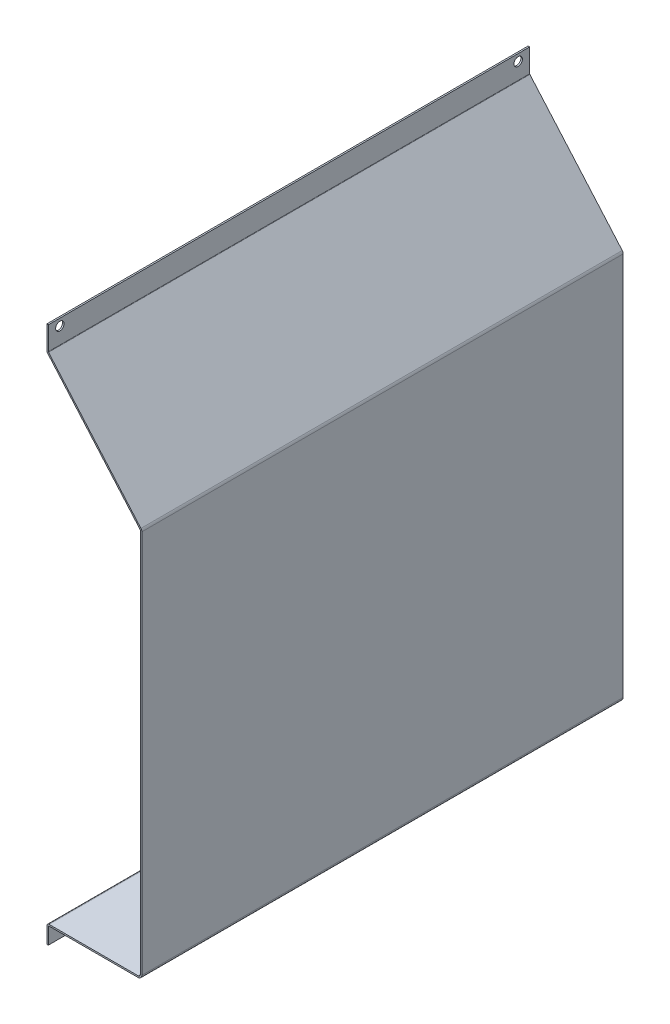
ISO-10303-21;
HEADER;
FILE_DESCRIPTION(('STEP AP214'),'2;1');
FILE_NAME('part.step','',(''),(''),'','','');
FILE_SCHEMA(('AUTOMOTIVE_DESIGN { 1 0 10303 214 1 1 1 1 }'));
ENDSEC;
DATA;
#1=APPLICATION_CONTEXT('core data for automotive mechanical design processes');
#2=APPLICATION_PROTOCOL_DEFINITION('international standard','automotive_design',2000,#1);
#3=PRODUCT_CONTEXT('',#1,'mechanical');
#4=PRODUCT('Part','Part','',(#3));
#5=PRODUCT_RELATED_PRODUCT_CATEGORY('part','',(#4));
#6=PRODUCT_DEFINITION_FORMATION('','',#4);
#7=PRODUCT_DEFINITION_CONTEXT('part definition',#1,'design');
#8=PRODUCT_DEFINITION('design','',#6,#7);
#9=PRODUCT_DEFINITION_SHAPE('','',#8);
#10=(LENGTH_UNIT() NAMED_UNIT(*) SI_UNIT(.MILLI.,.METRE.));
#11=(NAMED_UNIT(*) PLANE_ANGLE_UNIT() SI_UNIT($,.RADIAN.));
#12=(NAMED_UNIT(*) SI_UNIT($,.STERADIAN.) SOLID_ANGLE_UNIT());
#13=UNCERTAINTY_MEASURE_WITH_UNIT(LENGTH_MEASURE(1.E-05),#10,'distance_accuracy_value','');
#14=(GEOMETRIC_REPRESENTATION_CONTEXT(3) GLOBAL_UNCERTAINTY_ASSIGNED_CONTEXT((#13)) GLOBAL_UNIT_ASSIGNED_CONTEXT((#10,
#11,#12)) REPRESENTATION_CONTEXT('',''));
#15=CARTESIAN_POINT('',(0.,0.,0.));
#16=DIRECTION('',(0.,0.,1.));
#17=DIRECTION('',(1.,0.,0.));
#18=AXIS2_PLACEMENT_3D('',#15,#16,#17);
#19=CARTESIAN_POINT('',(1.,0.,157.));
#20=DIRECTION('',(0.,1.,0.));
#21=DIRECTION('',(0.,0.,1.));
#22=AXIS2_PLACEMENT_3D('',#19,#20,#21);
#23=PLANE('',#22);
#24=DIRECTION('',(1.,0.,0.));
#25=VECTOR('',#24,1.);
#26=CARTESIAN_POINT('',(1.,0.,-157.));
#27=LINE('',#26,#25);
#28=CARTESIAN_POINT('',(0.,0.,-157.));
#29=VERTEX_POINT('',#28);
#30=CARTESIAN_POINT('',(1.,0.,-157.));
#31=VERTEX_POINT('',#30);
#32=EDGE_CURVE('E170',#29,#31,#27,.T.);
#33=ORIENTED_EDGE('',*,*,#32,.T.);
#34=DIRECTION('',(0.,0.,-1.));
#35=VECTOR('',#34,1.);
#36=CARTESIAN_POINT('',(1.,0.,157.));
#37=LINE('',#36,#35);
#38=CARTESIAN_POINT('',(1.,0.,157.));
#39=VERTEX_POINT('',#38);
#40=EDGE_CURVE('E11',#39,#31,#37,.T.);
#41=ORIENTED_EDGE('',*,*,#40,.F.);
#42=DIRECTION('',(1.,0.,0.));
#43=VECTOR('',#42,1.);
#44=CARTESIAN_POINT('',(1.,0.,157.));
#45=LINE('',#44,#43);
#46=CARTESIAN_POINT('',(0.,0.,157.));
#47=VERTEX_POINT('',#46);
#48=EDGE_CURVE('E226',#47,#39,#45,.T.);
#49=ORIENTED_EDGE('',*,*,#48,.F.);
#50=DIRECTION('',(0.,0.,-1.));
#51=VECTOR('',#50,1.);
#52=CARTESIAN_POINT('',(0.,0.,157.));
#53=LINE('',#52,#51);
#54=EDGE_CURVE('E183',#47,#29,#53,.T.);
#55=ORIENTED_EDGE('',*,*,#54,.T.);
#56=EDGE_LOOP('',(#33,#41,#49,#55));
#57=FACE_BOUND('',#56,.T.);
#58=ADVANCED_FACE('F30',(#57),#23,.F.);
#59=CARTESIAN_POINT('',(1.,0.,157.));
#60=DIRECTION('',(-1.,0.,0.));
#61=DIRECTION('',(0.,0.,1.));
#62=AXIS2_PLACEMENT_3D('',#59,#60,#61);
#63=PLANE('',#62);
#64=CARTESIAN_POINT('',(1.,4.5,0.));
#65=DIRECTION('',(-1.,0.,0.));
#66=DIRECTION('',(0.,0.,1.));
#67=AXIS2_PLACEMENT_3D('',#64,#65,#66);
#68=CIRCLE('',#67,2.75);
#69=CARTESIAN_POINT('',(1.,4.5,2.75));
#70=VERTEX_POINT('',#69);
#71=EDGE_CURVE('E535',#70,#70,#68,.T.);
#72=ORIENTED_EDGE('',*,*,#71,.T.);
#73=EDGE_LOOP('',(#72));
#74=FACE_BOUND('',#73,.T.);
#75=DIRECTION('',(0.,1.,0.));
#76=VECTOR('',#75,1.);
#77=CARTESIAN_POINT('',(1.,0.,-157.));
#78=LINE('',#77,#76);
#79=CARTESIAN_POINT('',(1.,10.5,-157.));
#80=VERTEX_POINT('',#79);
#81=EDGE_CURVE('E166',#31,#80,#78,.T.);
#82=ORIENTED_EDGE('',*,*,#81,.T.);
#83=DIRECTION('',(0.,0.,-1.));
#84=VECTOR('',#83,1.);
#85=CARTESIAN_POINT('',(1.,10.5,157.));
#86=LINE('',#85,#84);
#87=CARTESIAN_POINT('',(1.,10.5,157.));
#88=VERTEX_POINT('',#87);
#89=EDGE_CURVE('E37',#88,#80,#86,.T.);
#90=ORIENTED_EDGE('',*,*,#89,.F.);
#91=DIRECTION('',(0.,1.,0.));
#92=VECTOR('',#91,1.);
#93=CARTESIAN_POINT('',(1.,0.,157.));
#94=LINE('',#93,#92);
#95=EDGE_CURVE('E179',#39,#88,#94,.T.);
#96=ORIENTED_EDGE('',*,*,#95,.F.);
#97=ORIENTED_EDGE('',*,*,#40,.T.);
#98=EDGE_LOOP('',(#82,#90,#96,#97));
#99=FACE_BOUND('',#98,.T.);
#100=ADVANCED_FACE('F178',(#74,#99),#63,.F.);
#101=CARTESIAN_POINT('',(1.5,10.5,157.));
#102=DIRECTION('',(0.,0.,-1.));
#103=DIRECTION('',(-1.,0.,0.));
#104=AXIS2_PLACEMENT_3D('',#101,#102,#103);
#105=CYLINDRICAL_SURFACE('',#104,0.499999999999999);
#106=CARTESIAN_POINT('',(1.5,10.5,-157.));
#107=DIRECTION('',(0.,0.,-1.));
#108=DIRECTION('',(-1.,0.,0.));
#109=AXIS2_PLACEMENT_3D('',#106,#107,#108);
#110=CIRCLE('',#109,0.499999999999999);
#111=CARTESIAN_POINT('',(1.5,11.,-157.));
#112=VERTEX_POINT('',#111);
#113=EDGE_CURVE('E172',#80,#112,#110,.T.);
#114=ORIENTED_EDGE('',*,*,#113,.T.);
#115=DIRECTION('',(0.,0.,-1.));
#116=VECTOR('',#115,1.);
#117=CARTESIAN_POINT('',(1.5,11.,157.));
#118=LINE('',#117,#116);
#119=CARTESIAN_POINT('',(1.5,11.,157.));
#120=VERTEX_POINT('',#119);
#121=EDGE_CURVE('E312',#120,#112,#118,.T.);
#122=ORIENTED_EDGE('',*,*,#121,.F.);
#123=CARTESIAN_POINT('',(1.5,10.5,157.));
#124=DIRECTION('',(0.,0.,-1.));
#125=DIRECTION('',(-1.,0.,0.));
#126=AXIS2_PLACEMENT_3D('',#123,#124,#125);
#127=CIRCLE('',#126,0.499999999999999);
#128=EDGE_CURVE('E229',#88,#120,#127,.T.);
#129=ORIENTED_EDGE('',*,*,#128,.F.);
#130=ORIENTED_EDGE('',*,*,#89,.T.);
#131=EDGE_LOOP('',(#114,#122,#129,#130));
#132=FACE_BOUND('',#131,.T.);
#133=ADVANCED_FACE('F316',(#132),#105,.F.);
#134=CARTESIAN_POINT('',(1.5,11.,157.));
#135=DIRECTION('',(0.,1.,0.));
#136=DIRECTION('',(0.,0.,1.));
#137=AXIS2_PLACEMENT_3D('',#134,#135,#136);
#138=PLANE('',#137);
#139=DIRECTION('',(1.,0.,0.));
#140=VECTOR('',#139,1.);
#141=CARTESIAN_POINT('',(1.5,11.,-157.));
#142=LINE('',#141,#140);
#143=CARTESIAN_POINT('',(59.5,11.,-157.));
#144=VERTEX_POINT('',#143);
#145=EDGE_CURVE('E192',#112,#144,#142,.T.);
#146=ORIENTED_EDGE('',*,*,#145,.T.);
#147=DIRECTION('',(0.,0.,-1.));
#148=VECTOR('',#147,1.);
#149=CARTESIAN_POINT('',(59.5,11.,157.));
#150=LINE('',#149,#148);
#151=CARTESIAN_POINT('',(59.5,11.,157.));
#152=VERTEX_POINT('',#151);
#153=EDGE_CURVE('E309',#152,#144,#150,.T.);
#154=ORIENTED_EDGE('',*,*,#153,.F.);
#155=DIRECTION('',(1.,0.,0.));
#156=VECTOR('',#155,1.);
#157=CARTESIAN_POINT('',(1.5,11.,157.));
#158=LINE('',#157,#156);
#159=EDGE_CURVE('E231',#120,#152,#158,.T.);
#160=ORIENTED_EDGE('',*,*,#159,.F.);
#161=ORIENTED_EDGE('',*,*,#121,.T.);
#162=EDGE_LOOP('',(#146,#154,#160,#161));
#163=FACE_BOUND('',#162,.T.);
#164=ADVANCED_FACE('F324',(#163),#138,.F.);
#165=CARTESIAN_POINT('',(59.5,13.5,157.));
#166=DIRECTION('',(0.,0.,-1.));
#167=DIRECTION('',(-1.,0.,0.));
#168=AXIS2_PLACEMENT_3D('',#165,#166,#167);
#169=CYLINDRICAL_SURFACE('',#168,2.5);
#170=CARTESIAN_POINT('',(59.5,13.5,-157.));
#171=DIRECTION('',(0.,0.,1.));
#172=DIRECTION('',(1.,0.,0.));
#173=AXIS2_PLACEMENT_3D('',#170,#171,#172);
#174=CIRCLE('',#173,2.5);
#175=CARTESIAN_POINT('',(62.,13.5,-157.));
#176=VERTEX_POINT('',#175);
#177=EDGE_CURVE('E194',#144,#176,#174,.T.);
#178=ORIENTED_EDGE('',*,*,#177,.T.);
#179=DIRECTION('',(0.,0.,-1.));
#180=VECTOR('',#179,1.);
#181=CARTESIAN_POINT('',(62.,13.5,157.));
#182=LINE('',#181,#180);
#183=CARTESIAN_POINT('',(62.,13.5,157.));
#184=VERTEX_POINT('',#183);
#185=EDGE_CURVE('E306',#184,#176,#182,.T.);
#186=ORIENTED_EDGE('',*,*,#185,.F.);
#187=CARTESIAN_POINT('',(59.5,13.5,157.));
#188=DIRECTION('',(0.,0.,1.));
#189=DIRECTION('',(1.,0.,0.));
#190=AXIS2_PLACEMENT_3D('',#187,#188,#189);
#191=CIRCLE('',#190,2.5);
#192=EDGE_CURVE('E233',#152,#184,#191,.T.);
#193=ORIENTED_EDGE('',*,*,#192,.F.);
#194=ORIENTED_EDGE('',*,*,#153,.T.);
#195=EDGE_LOOP('',(#178,#186,#193,#194));
#196=FACE_BOUND('',#195,.T.);
#197=ADVANCED_FACE('F327',(#196),#169,.T.);
#198=CARTESIAN_POINT('',(62.,13.5,157.));
#199=DIRECTION('',(-1.,0.,0.));
#200=DIRECTION('',(0.,0.,1.));
#201=AXIS2_PLACEMENT_3D('',#198,#199,#200);
#202=PLANE('',#201);
#203=DIRECTION('',(0.,1.,0.));
#204=VECTOR('',#203,1.);
#205=CARTESIAN_POINT('',(62.,13.5,-157.));
#206=LINE('',#205,#204);
#207=CARTESIAN_POINT('',(62.,264.039172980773,-157.));
#208=VERTEX_POINT('',#207);
#209=EDGE_CURVE('E196',#176,#208,#206,.T.);
#210=ORIENTED_EDGE('',*,*,#209,.T.);
#211=DIRECTION('',(0.,0.,-1.));
#212=VECTOR('',#211,1.);
#213=CARTESIAN_POINT('',(62.,264.039172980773,157.));
#214=LINE('',#213,#212);
#215=CARTESIAN_POINT('',(62.,264.039172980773,157.));
#216=VERTEX_POINT('',#215);
#217=EDGE_CURVE('E303',#216,#208,#214,.T.);
#218=ORIENTED_EDGE('',*,*,#217,.F.);
#219=DIRECTION('',(0.,1.,0.));
#220=VECTOR('',#219,1.);
#221=CARTESIAN_POINT('',(62.,13.5,157.));
#222=LINE('',#221,#220);
#223=EDGE_CURVE('E235',#184,#216,#222,.T.);
#224=ORIENTED_EDGE('',*,*,#223,.F.);
#225=ORIENTED_EDGE('',*,*,#185,.T.);
#226=EDGE_LOOP('',(#210,#218,#224,#225));
#227=FACE_BOUND('',#226,.T.);
#228=ADVANCED_FACE('F332',(#227),#202,.F.);
#229=CARTESIAN_POINT('',(59.5,264.039172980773,157.));
#230=DIRECTION('',(0.,0.,-1.));
#231=DIRECTION('',(-1.,0.,0.));
#232=AXIS2_PLACEMENT_3D('',#229,#230,#231);
#233=CYLINDRICAL_SURFACE('',#232,2.5);
#234=CARTESIAN_POINT('',(59.5,264.039172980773,-157.));
#235=DIRECTION('',(0.,0.,1.));
#236=DIRECTION('',(1.,0.,0.));
#237=AXIS2_PLACEMENT_3D('',#234,#235,#236);
#238=CIRCLE('',#237,2.5);
#239=CARTESIAN_POINT('',(61.3867739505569,265.679320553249,-157.));
#240=VERTEX_POINT('',#239);
#241=EDGE_CURVE('E198',#208,#240,#238,.T.);
#242=ORIENTED_EDGE('',*,*,#241,.T.);
#243=DIRECTION('',(0.,0.,-1.));
#244=VECTOR('',#243,1.);
#245=CARTESIAN_POINT('',(61.3867739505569,265.679320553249,157.));
#246=LINE('',#245,#244);
#247=CARTESIAN_POINT('',(61.3867739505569,265.679320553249,157.));
#248=VERTEX_POINT('',#247);
#249=EDGE_CURVE('E300',#248,#240,#246,.T.);
#250=ORIENTED_EDGE('',*,*,#249,.F.);
#251=CARTESIAN_POINT('',(59.5,264.039172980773,157.));
#252=DIRECTION('',(0.,0.,1.));
#253=DIRECTION('',(1.,0.,0.));
#254=AXIS2_PLACEMENT_3D('',#251,#252,#253);
#255=CIRCLE('',#254,2.5);
#256=EDGE_CURVE('E237',#216,#248,#255,.T.);
#257=ORIENTED_EDGE('',*,*,#256,.F.);
#258=ORIENTED_EDGE('',*,*,#217,.T.);
#259=EDGE_LOOP('',(#242,#250,#257,#258));
#260=FACE_BOUND('',#259,.T.);
#261=ADVANCED_FACE('F338',(#260),#233,.T.);
#262=CARTESIAN_POINT('',(61.3867739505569,265.679320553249,157.));
#263=DIRECTION('',(-0.754709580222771,-0.656059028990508,0.));
#264=DIRECTION('',(0.656059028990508,-0.754709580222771,0.));
#265=AXIS2_PLACEMENT_3D('',#262,#263,#264);
#266=PLANE('',#265);
#267=DIRECTION('',(-0.656059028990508,0.754709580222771,0.));
#268=VECTOR('',#267,1.);
#269=CARTESIAN_POINT('',(61.3867739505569,265.679320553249,-157.));
#270=LINE('',#269,#268);
#271=CARTESIAN_POINT('',(1.12264520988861,335.005270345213,-157.));
#272=VERTEX_POINT('',#271);
#273=EDGE_CURVE('E200',#240,#272,#270,.T.);
#274=ORIENTED_EDGE('',*,*,#273,.T.);
#275=DIRECTION('',(0.,0.,-1.));
#276=VECTOR('',#275,1.);
#277=CARTESIAN_POINT('',(1.12264520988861,335.005270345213,157.));
#278=LINE('',#277,#276);
#279=CARTESIAN_POINT('',(1.12264520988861,335.005270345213,157.));
#280=VERTEX_POINT('',#279);
#281=EDGE_CURVE('E297',#280,#272,#278,.T.);
#282=ORIENTED_EDGE('',*,*,#281,.F.);
#283=DIRECTION('',(-0.656059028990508,0.754709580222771,0.));
#284=VECTOR('',#283,1.);
#285=CARTESIAN_POINT('',(61.3867739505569,265.679320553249,157.));
#286=LINE('',#285,#284);
#287=EDGE_CURVE('E239',#248,#280,#286,.T.);
#288=ORIENTED_EDGE('',*,*,#287,.F.);
#289=ORIENTED_EDGE('',*,*,#249,.T.);
#290=EDGE_LOOP('',(#274,#282,#288,#289));
#291=FACE_BOUND('',#290,.T.);
#292=ADVANCED_FACE('F342',(#291),#266,.F.);
#293=CARTESIAN_POINT('',(1.5,335.333299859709,157.));
#294=DIRECTION('',(0.,0.,-1.));
#295=DIRECTION('',(-1.,0.,0.));
#296=AXIS2_PLACEMENT_3D('',#293,#294,#295);
#297=CYLINDRICAL_SURFACE('',#296,0.499999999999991);
#298=CARTESIAN_POINT('',(1.5,335.333299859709,-157.));
#299=DIRECTION('',(0.,0.,-1.));
#300=DIRECTION('',(-1.,0.,0.));
#301=AXIS2_PLACEMENT_3D('',#298,#299,#300);
#302=CIRCLE('',#301,0.499999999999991);
#303=CARTESIAN_POINT('',(1.00000000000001,335.333299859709,-157.));
#304=VERTEX_POINT('',#303);
#305=EDGE_CURVE('E202',#272,#304,#302,.T.);
#306=ORIENTED_EDGE('',*,*,#305,.T.);
#307=DIRECTION('',(0.,0.,-1.));
#308=VECTOR('',#307,1.);
#309=CARTESIAN_POINT('',(1.00000000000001,335.333299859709,157.));
#310=LINE('',#309,#308);
#311=CARTESIAN_POINT('',(1.00000000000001,335.333299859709,157.));
#312=VERTEX_POINT('',#311);
#313=EDGE_CURVE('E294',#312,#304,#310,.T.);
#314=ORIENTED_EDGE('',*,*,#313,.F.);
#315=CARTESIAN_POINT('',(1.5,335.333299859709,157.));
#316=DIRECTION('',(0.,0.,-1.));
#317=DIRECTION('',(-1.,0.,0.));
#318=AXIS2_PLACEMENT_3D('',#315,#316,#317);
#319=CIRCLE('',#318,0.499999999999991);
#320=EDGE_CURVE('E241',#280,#312,#319,.T.);
#321=ORIENTED_EDGE('',*,*,#320,.F.);
#322=ORIENTED_EDGE('',*,*,#281,.T.);
#323=EDGE_LOOP('',(#306,#314,#321,#322));
#324=FACE_BOUND('',#323,.T.);
#325=ADVANCED_FACE('F347',(#324),#297,.F.);
#326=CARTESIAN_POINT('',(1.00000000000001,335.333299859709,157.));
#327=DIRECTION('',(-1.,0.,0.));
#328=DIRECTION('',(0.,-1.,0.));
#329=AXIS2_PLACEMENT_3D('',#326,#327,#328);
#330=PLANE('',#329);
#331=CARTESIAN_POINT('',(1.,346.,149.5));
#332=DIRECTION('',(-1.,0.,0.));
#333=DIRECTION('',(0.,-1.,0.));
#334=AXIS2_PLACEMENT_3D('',#331,#332,#333);
#335=CIRCLE('',#334,2.75000000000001);
#336=CARTESIAN_POINT('',(1.,343.25,149.5));
#337=VERTEX_POINT('',#336);
#338=EDGE_CURVE('E539',#337,#337,#335,.T.);
#339=ORIENTED_EDGE('',*,*,#338,.T.);
#340=EDGE_LOOP('',(#339));
#341=FACE_BOUND('',#340,.T.);
#342=CARTESIAN_POINT('',(1.,346.,-149.5));
#343=DIRECTION('',(-1.,0.,0.));
#344=DIRECTION('',(0.,-1.,0.));
#345=AXIS2_PLACEMENT_3D('',#342,#343,#344);
#346=CIRCLE('',#345,2.75000000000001);
#347=CARTESIAN_POINT('',(1.,343.25,-149.5));
#348=VERTEX_POINT('',#347);
#349=EDGE_CURVE('E184',#348,#348,#346,.T.);
#350=ORIENTED_EDGE('',*,*,#349,.T.);
#351=EDGE_LOOP('',(#350));
#352=FACE_BOUND('',#351,.T.);
#353=DIRECTION('',(0.,1.,0.));
#354=VECTOR('',#353,1.);
#355=CARTESIAN_POINT('',(1.00000000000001,335.333299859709,-157.));
#356=LINE('',#355,#354);
#357=CARTESIAN_POINT('',(1.,350.5,-157.));
#358=VERTEX_POINT('',#357);
#359=EDGE_CURVE('E204',#304,#358,#356,.T.);
#360=ORIENTED_EDGE('',*,*,#359,.T.);
#361=DIRECTION('',(0.,0.,-1.));
#362=VECTOR('',#361,1.);
#363=CARTESIAN_POINT('',(1.,350.5,157.));
#364=LINE('',#363,#362);
#365=CARTESIAN_POINT('',(1.,350.5,157.));
#366=VERTEX_POINT('',#365);
#367=EDGE_CURVE('E291',#366,#358,#364,.T.);
#368=ORIENTED_EDGE('',*,*,#367,.F.);
#369=DIRECTION('',(0.,1.,0.));
#370=VECTOR('',#369,1.);
#371=CARTESIAN_POINT('',(1.00000000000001,335.333299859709,157.));
#372=LINE('',#371,#370);
#373=EDGE_CURVE('E243',#312,#366,#372,.T.);
#374=ORIENTED_EDGE('',*,*,#373,.F.);
#375=ORIENTED_EDGE('',*,*,#313,.T.);
#376=EDGE_LOOP('',(#360,#368,#374,#375));
#377=FACE_BOUND('',#376,.T.);
#378=ADVANCED_FACE('F353',(#341,#352,#377),#330,.F.);
#379=CARTESIAN_POINT('',(0.,350.5,157.));
#380=DIRECTION('',(0.,-1.,0.));
#381=DIRECTION('',(0.,0.,-1.));
#382=AXIS2_PLACEMENT_3D('',#379,#380,#381);
#383=PLANE('',#382);
#384=DIRECTION('',(-1.,0.,0.));
#385=VECTOR('',#384,1.);
#386=CARTESIAN_POINT('',(0.,350.5,-157.));
#387=LINE('',#386,#385);
#388=CARTESIAN_POINT('',(0.,350.5,-157.));
#389=VERTEX_POINT('',#388);
#390=EDGE_CURVE('E206',#358,#389,#387,.T.);
#391=ORIENTED_EDGE('',*,*,#390,.T.);
#392=DIRECTION('',(0.,0.,-1.));
#393=VECTOR('',#392,1.);
#394=CARTESIAN_POINT('',(0.,350.5,157.));
#395=LINE('',#394,#393);
#396=CARTESIAN_POINT('',(0.,350.5,157.));
#397=VERTEX_POINT('',#396);
#398=EDGE_CURVE('E288',#397,#389,#395,.T.);
#399=ORIENTED_EDGE('',*,*,#398,.F.);
#400=DIRECTION('',(-1.,0.,0.));
#401=VECTOR('',#400,1.);
#402=CARTESIAN_POINT('',(0.,350.5,157.));
#403=LINE('',#402,#401);
#404=EDGE_CURVE('E245',#366,#397,#403,.T.);
#405=ORIENTED_EDGE('',*,*,#404,.F.);
#406=ORIENTED_EDGE('',*,*,#367,.T.);
#407=EDGE_LOOP('',(#391,#399,#405,#406));
#408=FACE_BOUND('',#407,.T.);
#409=ADVANCED_FACE('F357',(#408),#383,.F.);
#410=CARTESIAN_POINT('',(0.,335.333299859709,157.));
#411=DIRECTION('',(1.,0.,0.));
#412=DIRECTION('',(0.,0.,-1.));
#413=AXIS2_PLACEMENT_3D('',#410,#411,#412);
#414=PLANE('',#413);
#415=CARTESIAN_POINT('',(0.,346.,149.5));
#416=DIRECTION('',(-1.,0.,0.));
#417=DIRECTION('',(0.,0.,-1.));
#418=AXIS2_PLACEMENT_3D('',#415,#416,#417);
#419=CIRCLE('',#418,2.75000000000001);
#420=CARTESIAN_POINT('',(0.,346.,146.75));
#421=VERTEX_POINT('',#420);
#422=EDGE_CURVE('E536',#421,#421,#419,.T.);
#423=ORIENTED_EDGE('',*,*,#422,.F.);
#424=EDGE_LOOP('',(#423));
#425=FACE_BOUND('',#424,.T.);
#426=CARTESIAN_POINT('',(0.,346.,-149.5));
#427=DIRECTION('',(-1.,0.,0.));
#428=DIRECTION('',(0.,0.,1.));
#429=AXIS2_PLACEMENT_3D('',#426,#427,#428);
#430=CIRCLE('',#429,2.75000000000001);
#431=CARTESIAN_POINT('',(0.,346.,-146.75));
#432=VERTEX_POINT('',#431);
#433=EDGE_CURVE('E187',#432,#432,#430,.T.);
#434=ORIENTED_EDGE('',*,*,#433,.F.);
#435=EDGE_LOOP('',(#434));
#436=FACE_BOUND('',#435,.T.);
#437=DIRECTION('',(0.,-1.,0.));
#438=VECTOR('',#437,1.);
#439=CARTESIAN_POINT('',(0.,335.333299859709,-157.));
#440=LINE('',#439,#438);
#441=CARTESIAN_POINT('',(0.,335.333299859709,-157.));
#442=VERTEX_POINT('',#441);
#443=EDGE_CURVE('E208',#389,#442,#440,.T.);
#444=ORIENTED_EDGE('',*,*,#443,.T.);
#445=DIRECTION('',(0.,0.,-1.));
#446=VECTOR('',#445,1.);
#447=CARTESIAN_POINT('',(0.,335.333299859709,157.));
#448=LINE('',#447,#446);
#449=CARTESIAN_POINT('',(0.,335.333299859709,157.));
#450=VERTEX_POINT('',#449);
#451=EDGE_CURVE('E285',#450,#442,#448,.T.);
#452=ORIENTED_EDGE('',*,*,#451,.F.);
#453=DIRECTION('',(0.,-1.,0.));
#454=VECTOR('',#453,1.);
#455=CARTESIAN_POINT('',(0.,335.333299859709,157.));
#456=LINE('',#455,#454);
#457=EDGE_CURVE('E247',#397,#450,#456,.T.);
#458=ORIENTED_EDGE('',*,*,#457,.F.);
#459=ORIENTED_EDGE('',*,*,#398,.T.);
#460=EDGE_LOOP('',(#444,#452,#458,#459));
#461=FACE_BOUND('',#460,.T.);
#462=ADVANCED_FACE('F362',(#425,#436,#461),#414,.F.);
#463=CARTESIAN_POINT('',(1.5,335.333299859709,157.));
#464=DIRECTION('',(0.,0.,-1.));
#465=DIRECTION('',(-1.,0.,0.));
#466=AXIS2_PLACEMENT_3D('',#463,#464,#465);
#467=CYLINDRICAL_SURFACE('',#466,1.49999999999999);
#468=CARTESIAN_POINT('',(1.5,335.333299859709,-157.));
#469=DIRECTION('',(0.,0.,1.));
#470=DIRECTION('',(-1.,0.,0.));
#471=AXIS2_PLACEMENT_3D('',#468,#469,#470);
#472=CIRCLE('',#471,1.49999999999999);
#473=CARTESIAN_POINT('',(0.367935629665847,334.349211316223,-157.));
#474=VERTEX_POINT('',#473);
#475=EDGE_CURVE('E210',#442,#474,#472,.T.);
#476=ORIENTED_EDGE('',*,*,#475,.T.);
#477=DIRECTION('',(0.,0.,-1.));
#478=VECTOR('',#477,1.);
#479=CARTESIAN_POINT('',(0.367935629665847,334.349211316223,157.));
#480=LINE('',#479,#478);
#481=CARTESIAN_POINT('',(0.367935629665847,334.349211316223,157.));
#482=VERTEX_POINT('',#481);
#483=EDGE_CURVE('E282',#482,#474,#480,.T.);
#484=ORIENTED_EDGE('',*,*,#483,.F.);
#485=CARTESIAN_POINT('',(1.5,335.333299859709,157.));
#486=DIRECTION('',(0.,0.,1.));
#487=DIRECTION('',(-1.,0.,0.));
#488=AXIS2_PLACEMENT_3D('',#485,#486,#487);
#489=CIRCLE('',#488,1.49999999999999);
#490=EDGE_CURVE('E249',#450,#482,#489,.T.);
#491=ORIENTED_EDGE('',*,*,#490,.F.);
#492=ORIENTED_EDGE('',*,*,#451,.T.);
#493=EDGE_LOOP('',(#476,#484,#491,#492));
#494=FACE_BOUND('',#493,.T.);
#495=ADVANCED_FACE('F368',(#494),#467,.T.);
#496=CARTESIAN_POINT('',(60.6320643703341,265.023261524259,157.));
#497=DIRECTION('',(0.754709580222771,0.656059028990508,0.));
#498=DIRECTION('',(-0.656059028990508,0.754709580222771,0.));
#499=AXIS2_PLACEMENT_3D('',#496,#497,#498);
#500=PLANE('',#499);
#501=DIRECTION('',(0.656059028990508,-0.754709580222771,0.));
#502=VECTOR('',#501,1.);
#503=CARTESIAN_POINT('',(60.6320643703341,265.023261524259,-157.));
#504=LINE('',#503,#502);
#505=CARTESIAN_POINT('',(60.6320643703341,265.023261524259,-157.));
#506=VERTEX_POINT('',#505);
#507=EDGE_CURVE('E212',#474,#506,#504,.T.);
#508=ORIENTED_EDGE('',*,*,#507,.T.);
#509=DIRECTION('',(0.,0.,-1.));
#510=VECTOR('',#509,1.);
#511=CARTESIAN_POINT('',(60.6320643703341,265.023261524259,157.));
#512=LINE('',#511,#510);
#513=CARTESIAN_POINT('',(60.6320643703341,265.023261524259,157.));
#514=VERTEX_POINT('',#513);
#515=EDGE_CURVE('E279',#514,#506,#512,.T.);
#516=ORIENTED_EDGE('',*,*,#515,.F.);
#517=DIRECTION('',(0.656059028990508,-0.754709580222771,0.));
#518=VECTOR('',#517,1.);
#519=CARTESIAN_POINT('',(60.6320643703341,265.023261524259,157.));
#520=LINE('',#519,#518);
#521=EDGE_CURVE('E251',#482,#514,#520,.T.);
#522=ORIENTED_EDGE('',*,*,#521,.F.);
#523=ORIENTED_EDGE('',*,*,#483,.T.);
#524=EDGE_LOOP('',(#508,#516,#522,#523));
#525=FACE_BOUND('',#524,.T.);
#526=ADVANCED_FACE('F372',(#525),#500,.F.);
#527=CARTESIAN_POINT('',(59.5,264.039172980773,157.));
#528=DIRECTION('',(0.,0.,-1.));
#529=DIRECTION('',(-1.,0.,0.));
#530=AXIS2_PLACEMENT_3D('',#527,#528,#529);
#531=CYLINDRICAL_SURFACE('',#530,1.5);
#532=CARTESIAN_POINT('',(59.5,264.039172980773,-157.));
#533=DIRECTION('',(0.,0.,-1.));
#534=DIRECTION('',(1.,0.,0.));
#535=AXIS2_PLACEMENT_3D('',#532,#533,#534);
#536=CIRCLE('',#535,1.5);
#537=CARTESIAN_POINT('',(61.,264.039172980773,-157.));
#538=VERTEX_POINT('',#537);
#539=EDGE_CURVE('E214',#506,#538,#536,.T.);
#540=ORIENTED_EDGE('',*,*,#539,.T.);
#541=DIRECTION('',(0.,0.,-1.));
#542=VECTOR('',#541,1.);
#543=CARTESIAN_POINT('',(61.,264.039172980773,157.));
#544=LINE('',#543,#542);
#545=CARTESIAN_POINT('',(61.,264.039172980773,157.));
#546=VERTEX_POINT('',#545);
#547=EDGE_CURVE('E276',#546,#538,#544,.T.);
#548=ORIENTED_EDGE('',*,*,#547,.F.);
#549=CARTESIAN_POINT('',(59.5,264.039172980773,157.));
#550=DIRECTION('',(0.,0.,-1.));
#551=DIRECTION('',(1.,0.,0.));
#552=AXIS2_PLACEMENT_3D('',#549,#550,#551);
#553=CIRCLE('',#552,1.5);
#554=EDGE_CURVE('E253',#514,#546,#553,.T.);
#555=ORIENTED_EDGE('',*,*,#554,.F.);
#556=ORIENTED_EDGE('',*,*,#515,.T.);
#557=EDGE_LOOP('',(#540,#548,#555,#556));
#558=FACE_BOUND('',#557,.T.);
#559=ADVANCED_FACE('F377',(#558),#531,.F.);
#560=CARTESIAN_POINT('',(61.,13.5,157.));
#561=DIRECTION('',(1.,0.,0.));
#562=DIRECTION('',(0.,1.,0.));
#563=AXIS2_PLACEMENT_3D('',#560,#561,#562);
#564=PLANE('',#563);
#565=DIRECTION('',(0.,-1.,0.));
#566=VECTOR('',#565,1.);
#567=CARTESIAN_POINT('',(61.,13.5,-157.));
#568=LINE('',#567,#566);
#569=CARTESIAN_POINT('',(61.,13.5,-157.));
#570=VERTEX_POINT('',#569);
#571=EDGE_CURVE('E216',#538,#570,#568,.T.);
#572=ORIENTED_EDGE('',*,*,#571,.T.);
#573=DIRECTION('',(0.,0.,-1.));
#574=VECTOR('',#573,1.);
#575=CARTESIAN_POINT('',(61.,13.5,157.));
#576=LINE('',#575,#574);
#577=CARTESIAN_POINT('',(61.,13.5,157.));
#578=VERTEX_POINT('',#577);
#579=EDGE_CURVE('E273',#578,#570,#576,.T.);
#580=ORIENTED_EDGE('',*,*,#579,.F.);
#581=DIRECTION('',(0.,-1.,0.));
#582=VECTOR('',#581,1.);
#583=CARTESIAN_POINT('',(61.,13.5,157.));
#584=LINE('',#583,#582);
#585=EDGE_CURVE('E255',#546,#578,#584,.T.);
#586=ORIENTED_EDGE('',*,*,#585,.F.);
#587=ORIENTED_EDGE('',*,*,#547,.T.);
#588=EDGE_LOOP('',(#572,#580,#586,#587));
#589=FACE_BOUND('',#588,.T.);
#590=ADVANCED_FACE('F383',(#589),#564,.F.);
#591=CARTESIAN_POINT('',(59.5,13.5,157.));
#592=DIRECTION('',(0.,0.,-1.));
#593=DIRECTION('',(-1.,0.,0.));
#594=AXIS2_PLACEMENT_3D('',#591,#592,#593);
#595=CYLINDRICAL_SURFACE('',#594,1.5);
#596=CARTESIAN_POINT('',(59.5,13.5,-157.));
#597=DIRECTION('',(0.,0.,-1.));
#598=DIRECTION('',(1.,0.,0.));
#599=AXIS2_PLACEMENT_3D('',#596,#597,#598);
#600=CIRCLE('',#599,1.5);
#601=CARTESIAN_POINT('',(59.5,12.,-157.));
#602=VERTEX_POINT('',#601);
#603=EDGE_CURVE('E218',#570,#602,#600,.T.);
#604=ORIENTED_EDGE('',*,*,#603,.T.);
#605=DIRECTION('',(0.,0.,-1.));
#606=VECTOR('',#605,1.);
#607=CARTESIAN_POINT('',(59.5,12.,157.));
#608=LINE('',#607,#606);
#609=CARTESIAN_POINT('',(59.5,12.,157.));
#610=VERTEX_POINT('',#609);
#611=EDGE_CURVE('E270',#610,#602,#608,.T.);
#612=ORIENTED_EDGE('',*,*,#611,.F.);
#613=CARTESIAN_POINT('',(59.5,13.5,157.));
#614=DIRECTION('',(0.,0.,-1.));
#615=DIRECTION('',(1.,0.,0.));
#616=AXIS2_PLACEMENT_3D('',#613,#614,#615);
#617=CIRCLE('',#616,1.5);
#618=EDGE_CURVE('E257',#578,#610,#617,.T.);
#619=ORIENTED_EDGE('',*,*,#618,.F.);
#620=ORIENTED_EDGE('',*,*,#579,.T.);
#621=EDGE_LOOP('',(#604,#612,#619,#620));
#622=FACE_BOUND('',#621,.T.);
#623=ADVANCED_FACE('F387',(#622),#595,.F.);
#624=CARTESIAN_POINT('',(1.5,12.,157.));
#625=DIRECTION('',(0.,-1.,0.));
#626=DIRECTION('',(0.,0.,-1.));
#627=AXIS2_PLACEMENT_3D('',#624,#625,#626);
#628=PLANE('',#627);
#629=DIRECTION('',(-1.,0.,0.));
#630=VECTOR('',#629,1.);
#631=CARTESIAN_POINT('',(1.5,12.,-157.));
#632=LINE('',#631,#630);
#633=CARTESIAN_POINT('',(1.5,12.,-157.));
#634=VERTEX_POINT('',#633);
#635=EDGE_CURVE('E220',#602,#634,#632,.T.);
#636=ORIENTED_EDGE('',*,*,#635,.T.);
#637=DIRECTION('',(0.,0.,-1.));
#638=VECTOR('',#637,1.);
#639=CARTESIAN_POINT('',(1.5,12.,157.));
#640=LINE('',#639,#638);
#641=CARTESIAN_POINT('',(1.5,12.,157.));
#642=VERTEX_POINT('',#641);
#643=EDGE_CURVE('E267',#642,#634,#640,.T.);
#644=ORIENTED_EDGE('',*,*,#643,.F.);
#645=DIRECTION('',(-1.,0.,0.));
#646=VECTOR('',#645,1.);
#647=CARTESIAN_POINT('',(1.5,12.,157.));
#648=LINE('',#647,#646);
#649=EDGE_CURVE('E259',#610,#642,#648,.T.);
#650=ORIENTED_EDGE('',*,*,#649,.F.);
#651=ORIENTED_EDGE('',*,*,#611,.T.);
#652=EDGE_LOOP('',(#636,#644,#650,#651));
#653=FACE_BOUND('',#652,.T.);
#654=ADVANCED_FACE('F392',(#653),#628,.F.);
#655=CARTESIAN_POINT('',(1.5,10.5,157.));
#656=DIRECTION('',(0.,0.,-1.));
#657=DIRECTION('',(-1.,0.,0.));
#658=AXIS2_PLACEMENT_3D('',#655,#656,#657);
#659=CYLINDRICAL_SURFACE('',#658,1.5);
#660=CARTESIAN_POINT('',(1.5,10.5,-157.));
#661=DIRECTION('',(0.,0.,1.));
#662=DIRECTION('',(-1.,0.,0.));
#663=AXIS2_PLACEMENT_3D('',#660,#661,#662);
#664=CIRCLE('',#663,1.5);
#665=CARTESIAN_POINT('',(0.,10.5,-157.));
#666=VERTEX_POINT('',#665);
#667=EDGE_CURVE('E222',#634,#666,#664,.T.);
#668=ORIENTED_EDGE('',*,*,#667,.T.);
#669=DIRECTION('',(0.,0.,-1.));
#670=VECTOR('',#669,1.);
#671=CARTESIAN_POINT('',(0.,10.5,157.));
#672=LINE('',#671,#670);
#673=CARTESIAN_POINT('',(0.,10.5,157.));
#674=VERTEX_POINT('',#673);
#675=EDGE_CURVE('E264',#674,#666,#672,.T.);
#676=ORIENTED_EDGE('',*,*,#675,.F.);
#677=CARTESIAN_POINT('',(1.5,10.5,157.));
#678=DIRECTION('',(0.,0.,1.));
#679=DIRECTION('',(-1.,0.,0.));
#680=AXIS2_PLACEMENT_3D('',#677,#678,#679);
#681=CIRCLE('',#680,1.5);
#682=EDGE_CURVE('E49',#642,#674,#681,.T.);
#683=ORIENTED_EDGE('',*,*,#682,.F.);
#684=ORIENTED_EDGE('',*,*,#643,.T.);
#685=EDGE_LOOP('',(#668,#676,#683,#684));
#686=FACE_BOUND('',#685,.T.);
#687=ADVANCED_FACE('F395',(#686),#659,.T.);
#688=CARTESIAN_POINT('',(0.,0.,157.));
#689=DIRECTION('',(1.,0.,0.));
#690=DIRECTION('',(0.,0.,-1.));
#691=AXIS2_PLACEMENT_3D('',#688,#689,#690);
#692=PLANE('',#691);
#693=CARTESIAN_POINT('',(0.,4.5,0.));
#694=DIRECTION('',(-1.,0.,0.));
#695=DIRECTION('',(0.,0.,1.));
#696=AXIS2_PLACEMENT_3D('',#693,#694,#695);
#697=CIRCLE('',#696,2.75);
#698=CARTESIAN_POINT('',(0.,4.5,2.75));
#699=VERTEX_POINT('',#698);
#700=EDGE_CURVE('E533',#699,#699,#697,.T.);
#701=ORIENTED_EDGE('',*,*,#700,.F.);
#702=EDGE_LOOP('',(#701));
#703=FACE_BOUND('',#702,.T.);
#704=DIRECTION('',(0.,-1.,0.));
#705=VECTOR('',#704,1.);
#706=CARTESIAN_POINT('',(0.,0.,-157.));
#707=LINE('',#706,#705);
#708=EDGE_CURVE('E224',#666,#29,#707,.T.);
#709=ORIENTED_EDGE('',*,*,#708,.T.);
#710=ORIENTED_EDGE('',*,*,#54,.F.);
#711=DIRECTION('',(0.,-1.,0.));
#712=VECTOR('',#711,1.);
#713=CARTESIAN_POINT('',(0.,0.,157.));
#714=LINE('',#713,#712);
#715=EDGE_CURVE('E44',#674,#47,#714,.T.);
#716=ORIENTED_EDGE('',*,*,#715,.F.);
#717=ORIENTED_EDGE('',*,*,#675,.T.);
#718=EDGE_LOOP('',(#709,#710,#716,#717));
#719=FACE_BOUND('',#718,.T.);
#720=ADVANCED_FACE('F397',(#703,#719),#692,.F.);
#721=CARTESIAN_POINT('',(1.5,10.5,157.));
#722=DIRECTION('',(0.,0.,-1.));
#723=DIRECTION('',(-1.,0.,0.));
#724=AXIS2_PLACEMENT_3D('',#721,#722,#723);
#725=PLANE('',#724);
#726=ORIENTED_EDGE('',*,*,#48,.T.);
#727=ORIENTED_EDGE('',*,*,#95,.T.);
#728=ORIENTED_EDGE('',*,*,#128,.T.);
#729=ORIENTED_EDGE('',*,*,#159,.T.);
#730=ORIENTED_EDGE('',*,*,#192,.T.);
#731=ORIENTED_EDGE('',*,*,#223,.T.);
#732=ORIENTED_EDGE('',*,*,#256,.T.);
#733=ORIENTED_EDGE('',*,*,#287,.T.);
#734=ORIENTED_EDGE('',*,*,#320,.T.);
#735=ORIENTED_EDGE('',*,*,#373,.T.);
#736=ORIENTED_EDGE('',*,*,#404,.T.);
#737=ORIENTED_EDGE('',*,*,#457,.T.);
#738=ORIENTED_EDGE('',*,*,#490,.T.);
#739=ORIENTED_EDGE('',*,*,#521,.T.);
#740=ORIENTED_EDGE('',*,*,#554,.T.);
#741=ORIENTED_EDGE('',*,*,#585,.T.);
#742=ORIENTED_EDGE('',*,*,#618,.T.);
#743=ORIENTED_EDGE('',*,*,#649,.T.);
#744=ORIENTED_EDGE('',*,*,#682,.T.);
#745=ORIENTED_EDGE('',*,*,#715,.T.);
#746=EDGE_LOOP('',(#726,#727,#728,#729,#730,#731,#732,#733,#734,#735,#736,#737,#738,#739,#740,
#741,#742,#743,#744,#745));
#747=FACE_BOUND('',#746,.T.);
#748=ADVANCED_FACE('F319',(#747),#725,.F.);
#749=CARTESIAN_POINT('',(1.5,10.5,-157.));
#750=DIRECTION('',(0.,0.,-1.));
#751=DIRECTION('',(-1.,0.,0.));
#752=AXIS2_PLACEMENT_3D('',#749,#750,#751);
#753=PLANE('',#752);
#754=ORIENTED_EDGE('',*,*,#32,.F.);
#755=ORIENTED_EDGE('',*,*,#708,.F.);
#756=ORIENTED_EDGE('',*,*,#667,.F.);
#757=ORIENTED_EDGE('',*,*,#635,.F.);
#758=ORIENTED_EDGE('',*,*,#603,.F.);
#759=ORIENTED_EDGE('',*,*,#571,.F.);
#760=ORIENTED_EDGE('',*,*,#539,.F.);
#761=ORIENTED_EDGE('',*,*,#507,.F.);
#762=ORIENTED_EDGE('',*,*,#475,.F.);
#763=ORIENTED_EDGE('',*,*,#443,.F.);
#764=ORIENTED_EDGE('',*,*,#390,.F.);
#765=ORIENTED_EDGE('',*,*,#359,.F.);
#766=ORIENTED_EDGE('',*,*,#305,.F.);
#767=ORIENTED_EDGE('',*,*,#273,.F.);
#768=ORIENTED_EDGE('',*,*,#241,.F.);
#769=ORIENTED_EDGE('',*,*,#209,.F.);
#770=ORIENTED_EDGE('',*,*,#177,.F.);
#771=ORIENTED_EDGE('',*,*,#145,.F.);
#772=ORIENTED_EDGE('',*,*,#113,.F.);
#773=ORIENTED_EDGE('',*,*,#81,.F.);
#774=EDGE_LOOP('',(#754,#755,#756,#757,#758,#759,#760,#761,#762,#763,#764,#765,#766,#767,#768,
#769,#770,#771,#772,#773));
#775=FACE_BOUND('',#774,.T.);
#776=ADVANCED_FACE('F167',(#775),#753,.T.);
#777=CARTESIAN_POINT('',(62.,346.,-149.5));
#778=DIRECTION('',(-1.,0.,0.));
#779=DIRECTION('',(0.,0.,1.));
#780=AXIS2_PLACEMENT_3D('',#777,#778,#779);
#781=CYLINDRICAL_SURFACE('',#780,2.75000000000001);
#782=ORIENTED_EDGE('',*,*,#433,.T.);
#783=EDGE_LOOP('',(#782));
#784=FACE_BOUND('',#783,.T.);
#785=ORIENTED_EDGE('',*,*,#349,.F.);
#786=EDGE_LOOP('',(#785));
#787=FACE_BOUND('',#786,.T.);
#788=ADVANCED_FACE('F473',(#784,#787),#781,.F.);
#789=CARTESIAN_POINT('',(62.,346.,149.5));
#790=DIRECTION('',(-1.,0.,0.));
#791=DIRECTION('',(0.,0.,1.));
#792=AXIS2_PLACEMENT_3D('',#789,#790,#791);
#793=CYLINDRICAL_SURFACE('',#792,2.75000000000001);
#794=ORIENTED_EDGE('',*,*,#422,.T.);
#795=EDGE_LOOP('',(#794));
#796=FACE_BOUND('',#795,.T.);
#797=ORIENTED_EDGE('',*,*,#338,.F.);
#798=EDGE_LOOP('',(#797));
#799=FACE_BOUND('',#798,.T.);
#800=ADVANCED_FACE('F507',(#796,#799),#793,.F.);
#801=CARTESIAN_POINT('',(62.,4.5,0.));
#802=DIRECTION('',(-1.,0.,0.));
#803=DIRECTION('',(0.,0.,1.));
#804=AXIS2_PLACEMENT_3D('',#801,#802,#803);
#805=CYLINDRICAL_SURFACE('',#804,2.75);
#806=ORIENTED_EDGE('',*,*,#700,.T.);
#807=EDGE_LOOP('',(#806));
#808=FACE_BOUND('',#807,.T.);
#809=ORIENTED_EDGE('',*,*,#71,.F.);
#810=EDGE_LOOP('',(#809));
#811=FACE_BOUND('',#810,.T.);
#812=ADVANCED_FACE('F517',(#808,#811),#805,.F.);
#813=CLOSED_SHELL('',(#58,#100,#133,#164,#197,#228,#261,#292,#325,#378,#409,#462,#495,#526,#559,
#590,#623,#654,#687,#720,#748,#776,#788,#800,#812));
#814=MANIFOLD_SOLID_BREP('B2',#813);
#815=ADVANCED_BREP_SHAPE_REPRESENTATION('',(#18,#814),#14);
#816=SHAPE_DEFINITION_REPRESENTATION(#9,#815);
ENDSEC;
END-ISO-10303-21;
